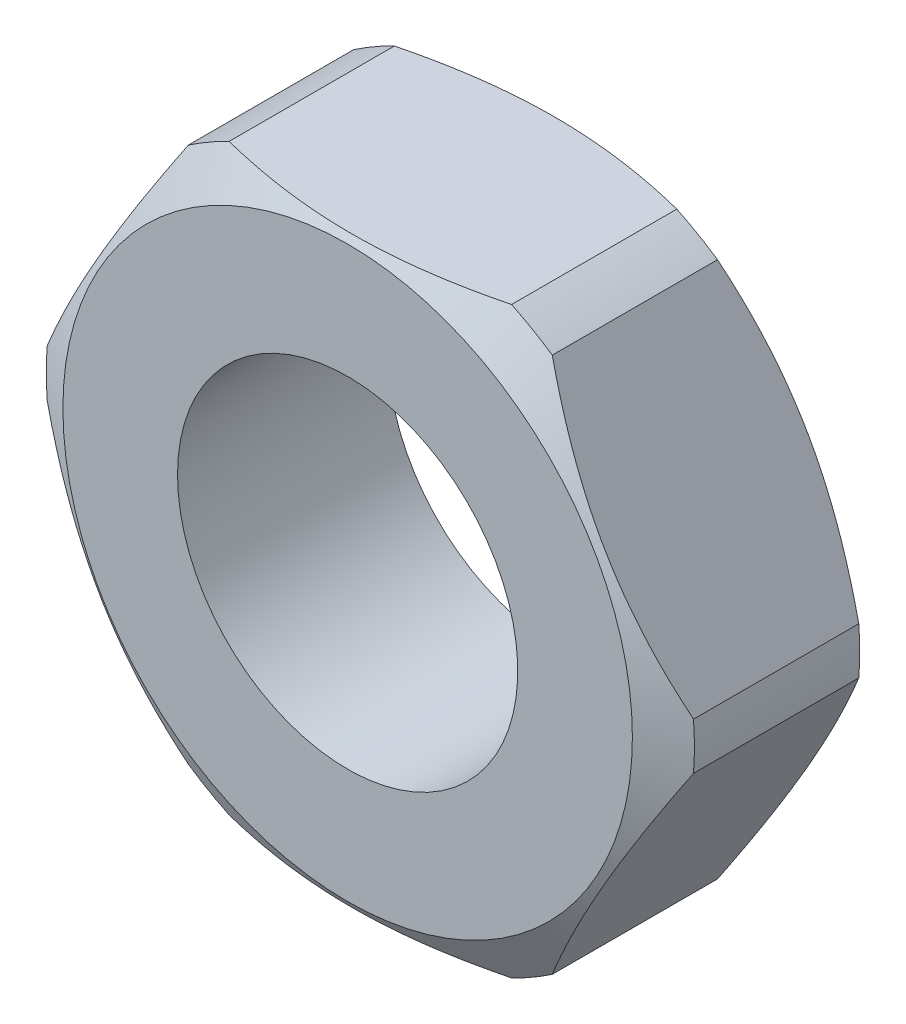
ISO-10303-21;
HEADER;
FILE_DESCRIPTION(('STEP AP214'),'2;1');
FILE_NAME('part.step','',(''),(''),'','','');
FILE_SCHEMA(('AUTOMOTIVE_DESIGN { 1 0 10303 214 1 1 1 1 }'));
ENDSEC;
DATA;
#1=APPLICATION_CONTEXT('core data for automotive mechanical design processes');
#2=APPLICATION_PROTOCOL_DEFINITION('international standard','automotive_design',2000,#1);
#3=PRODUCT_CONTEXT('',#1,'mechanical');
#4=PRODUCT('Part','Part','',(#3));
#5=PRODUCT_RELATED_PRODUCT_CATEGORY('part','',(#4));
#6=PRODUCT_DEFINITION_FORMATION('','',#4);
#7=PRODUCT_DEFINITION_CONTEXT('part definition',#1,'design');
#8=PRODUCT_DEFINITION('design','',#6,#7);
#9=PRODUCT_DEFINITION_SHAPE('','',#8);
#10=(LENGTH_UNIT() NAMED_UNIT(*) SI_UNIT(.MILLI.,.METRE.));
#11=(NAMED_UNIT(*) PLANE_ANGLE_UNIT() SI_UNIT($,.RADIAN.));
#12=(NAMED_UNIT(*) SI_UNIT($,.STERADIAN.) SOLID_ANGLE_UNIT());
#13=UNCERTAINTY_MEASURE_WITH_UNIT(LENGTH_MEASURE(1.E-05),#10,'distance_accuracy_value','');
#14=(GEOMETRIC_REPRESENTATION_CONTEXT(3) GLOBAL_UNCERTAINTY_ASSIGNED_CONTEXT((#13)) GLOBAL_UNIT_ASSIGNED_CONTEXT((#10,
#11,#12)) REPRESENTATION_CONTEXT('',''));
#15=CARTESIAN_POINT('',(0.,0.,0.));
#16=DIRECTION('',(0.,0.,1.));
#17=DIRECTION('',(1.,0.,0.));
#18=AXIS2_PLACEMENT_3D('',#15,#16,#17);
#19=CARTESIAN_POINT('',(0.,0.,6.5));
#20=DIRECTION('',(0.,0.,-1.));
#21=DIRECTION('',(-1.,0.,0.));
#22=AXIS2_PLACEMENT_3D('',#19,#20,#21);
#23=CYLINDRICAL_SURFACE('',#22,10.);
#24=CARTESIAN_POINT('',(0.,0.,5.79999999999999));
#25=DIRECTION('',(0.,0.,1.));
#26=DIRECTION('',(1.,0.,0.));
#27=AXIS2_PLACEMENT_3D('',#24,#25,#26);
#28=CIRCLE('',#27,10.);
#29=CARTESIAN_POINT('',(-9.9737559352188,-0.724011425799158,5.79999999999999));
#30=VERTEX_POINT('',#29);
#31=CARTESIAN_POINT('',(-9.97370406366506,0.72472563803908,5.79999999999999));
#32=VERTEX_POINT('',#31);
#33=EDGE_CURVE('E143',#30,#32,#28,.F.);
#34=ORIENTED_EDGE('',*,*,#33,.T.);
#35=DIRECTION('',(0.,0.,-1.));
#36=VECTOR('',#35,1.);
#37=CARTESIAN_POINT('',(-9.97370406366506,0.724725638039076,6.5));
#38=LINE('',#37,#36);
#39=CARTESIAN_POINT('',(-9.97370406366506,0.724725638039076,0.700000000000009));
#40=VERTEX_POINT('',#39);
#41=EDGE_CURVE('E51',#32,#40,#38,.T.);
#42=ORIENTED_EDGE('',*,*,#41,.T.);
#43=CARTESIAN_POINT('',(0.,0.,0.700000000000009));
#44=DIRECTION('',(0.,0.,1.));
#45=DIRECTION('',(1.,0.,0.));
#46=AXIS2_PLACEMENT_3D('',#43,#44,#45);
#47=CIRCLE('',#46,10.);
#48=CARTESIAN_POINT('',(-9.9737559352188,-0.724011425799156,0.700000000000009));
#49=VERTEX_POINT('',#48);
#50=EDGE_CURVE('E291',#40,#49,#47,.T.);
#51=ORIENTED_EDGE('',*,*,#50,.T.);
#52=DIRECTION('',(0.,0.,-1.));
#53=VECTOR('',#52,1.);
#54=CARTESIAN_POINT('',(-9.9737559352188,-0.724011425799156,6.5));
#55=LINE('',#54,#53);
#56=EDGE_CURVE('E290',#49,#30,#55,.F.);
#57=ORIENTED_EDGE('',*,*,#56,.T.);
#58=EDGE_LOOP('',(#34,#42,#51,#57));
#59=FACE_BOUND('',#58,.T.);
#60=ADVANCED_FACE('F32',(#59),#23,.T.);
#61=CARTESIAN_POINT('',(-4.3601878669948,-8.99937563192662,5.80000000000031));
#62=VERTEX_POINT('',#61);
#63=CARTESIAN_POINT('',(-5.61389025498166,-8.27552029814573,5.79999999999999));
#64=VERTEX_POINT('',#63);
#65=EDGE_CURVE('E147',#62,#64,#28,.F.);
#66=ORIENTED_EDGE('',*,*,#65,.T.);
#67=DIRECTION('',(0.,0.,-1.));
#68=VECTOR('',#67,1.);
#69=CARTESIAN_POINT('',(-5.61389025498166,-8.27552029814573,6.5));
#70=LINE('',#69,#68);
#71=CARTESIAN_POINT('',(-5.61389025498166,-8.27552029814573,0.700000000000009));
#72=VERTEX_POINT('',#71);
#73=EDGE_CURVE('E59',#64,#72,#70,.T.);
#74=ORIENTED_EDGE('',*,*,#73,.T.);
#75=CARTESIAN_POINT('',(-4.36018786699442,-8.99937563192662,0.700000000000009));
#76=VERTEX_POINT('',#75);
#77=EDGE_CURVE('E299',#72,#76,#47,.T.);
#78=ORIENTED_EDGE('',*,*,#77,.T.);
#79=DIRECTION('',(0.,0.,-1.));
#80=VECTOR('',#79,1.);
#81=CARTESIAN_POINT('',(-4.36018786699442,-8.99937563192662,6.5));
#82=LINE('',#81,#80);
#83=EDGE_CURVE('E177',#76,#62,#82,.F.);
#84=ORIENTED_EDGE('',*,*,#83,.T.);
#85=EDGE_LOOP('',(#66,#74,#78,#84));
#86=FACE_BOUND('',#85,.T.);
#87=ADVANCED_FACE('F174',(#86),#23,.T.);
#88=CARTESIAN_POINT('',(5.61389025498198,-8.27552029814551,5.79999999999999));
#89=VERTEX_POINT('',#88);
#90=CARTESIAN_POINT('',(4.36018786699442,-8.99937563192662,5.79999999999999));
#91=VERTEX_POINT('',#90);
#92=EDGE_CURVE('E160',#89,#91,#28,.F.);
#93=ORIENTED_EDGE('',*,*,#92,.T.);
#94=DIRECTION('',(0.,0.,-1.));
#95=VECTOR('',#94,1.);
#96=CARTESIAN_POINT('',(4.36018786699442,-8.99937563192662,6.5));
#97=LINE('',#96,#95);
#98=CARTESIAN_POINT('',(4.36018786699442,-8.99937563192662,0.700000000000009));
#99=VERTEX_POINT('',#98);
#100=EDGE_CURVE('E255',#91,#99,#97,.T.);
#101=ORIENTED_EDGE('',*,*,#100,.T.);
#102=CARTESIAN_POINT('',(5.61389025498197,-8.27552029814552,0.700000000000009));
#103=VERTEX_POINT('',#102);
#104=EDGE_CURVE('E301',#99,#103,#47,.T.);
#105=ORIENTED_EDGE('',*,*,#104,.T.);
#106=DIRECTION('',(0.,0.,-1.));
#107=VECTOR('',#106,1.);
#108=CARTESIAN_POINT('',(5.61389025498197,-8.27552029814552,6.5));
#109=LINE('',#108,#107);
#110=EDGE_CURVE('E254',#103,#89,#109,.F.);
#111=ORIENTED_EDGE('',*,*,#110,.T.);
#112=EDGE_LOOP('',(#93,#101,#105,#111));
#113=FACE_BOUND('',#112,.T.);
#114=ADVANCED_FACE('F288',(#113),#23,.T.);
#115=CARTESIAN_POINT('',(9.97370406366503,0.724725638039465,5.79999999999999));
#116=VERTEX_POINT('',#115);
#117=CARTESIAN_POINT('',(9.97375593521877,-0.724011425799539,5.79999999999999));
#118=VERTEX_POINT('',#117);
#119=EDGE_CURVE('E154',#116,#118,#28,.F.);
#120=ORIENTED_EDGE('',*,*,#119,.T.);
#121=DIRECTION('',(0.,0.,-1.));
#122=VECTOR('',#121,1.);
#123=CARTESIAN_POINT('',(9.97375593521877,-0.724011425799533,6.5));
#124=LINE('',#123,#122);
#125=CARTESIAN_POINT('',(9.97375593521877,-0.724011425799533,0.700000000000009));
#126=VERTEX_POINT('',#125);
#127=EDGE_CURVE('E256',#118,#126,#124,.T.);
#128=ORIENTED_EDGE('',*,*,#127,.T.);
#129=CARTESIAN_POINT('',(9.97370406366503,0.724725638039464,0.700000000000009));
#130=VERTEX_POINT('',#129);
#131=EDGE_CURVE('E158',#126,#130,#47,.T.);
#132=ORIENTED_EDGE('',*,*,#131,.T.);
#133=DIRECTION('',(0.,0.,-1.));
#134=VECTOR('',#133,1.);
#135=CARTESIAN_POINT('',(9.97370406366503,0.724725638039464,6.5));
#136=LINE('',#135,#134);
#137=EDGE_CURVE('E258',#130,#116,#136,.F.);
#138=ORIENTED_EDGE('',*,*,#137,.T.);
#139=EDGE_LOOP('',(#120,#128,#132,#138));
#140=FACE_BOUND('',#139,.T.);
#141=ADVANCED_FACE('F335',(#140),#23,.T.);
#142=CARTESIAN_POINT('',(4.35889894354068,9.,5.79999999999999));
#143=VERTEX_POINT('',#142);
#144=CARTESIAN_POINT('',(5.61448284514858,8.27511826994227,5.79999999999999));
#145=VERTEX_POINT('',#144);
#146=EDGE_CURVE('E146',#143,#145,#28,.F.);
#147=ORIENTED_EDGE('',*,*,#146,.T.);
#148=DIRECTION('',(0.,0.,-1.));
#149=VECTOR('',#148,1.);
#150=CARTESIAN_POINT('',(5.61448284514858,8.27511826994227,6.5));
#151=LINE('',#150,#149);
#152=CARTESIAN_POINT('',(5.61448284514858,8.27511826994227,0.700000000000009));
#153=VERTEX_POINT('',#152);
#154=EDGE_CURVE('E262',#145,#153,#151,.T.);
#155=ORIENTED_EDGE('',*,*,#154,.T.);
#156=CARTESIAN_POINT('',(4.35889894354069,8.99999999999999,0.700000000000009));
#157=VERTEX_POINT('',#156);
#158=EDGE_CURVE('E153',#153,#157,#47,.T.);
#159=ORIENTED_EDGE('',*,*,#158,.T.);
#160=DIRECTION('',(0.,0.,-1.));
#161=VECTOR('',#160,1.);
#162=CARTESIAN_POINT('',(4.35889894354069,8.99999999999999,6.5));
#163=LINE('',#162,#161);
#164=EDGE_CURVE('E265',#157,#143,#163,.F.);
#165=ORIENTED_EDGE('',*,*,#164,.T.);
#166=EDGE_LOOP('',(#147,#155,#159,#165));
#167=FACE_BOUND('',#166,.T.);
#168=ADVANCED_FACE('F282',(#167),#23,.T.);
#169=CARTESIAN_POINT('',(0.,0.,6.5));
#170=DIRECTION('',(0.,0.,1.));
#171=DIRECTION('',(1.,0.,0.));
#172=AXIS2_PLACEMENT_3D('',#169,#170,#171);
#173=PLANE('',#172);
#174=CARTESIAN_POINT('',(0.,0.,6.5));
#175=DIRECTION('',(0.,0.,1.));
#176=DIRECTION('',(1.,0.,0.));
#177=AXIS2_PLACEMENT_3D('',#174,#175,#176);
#178=CIRCLE('',#177,8.78756443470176);
#179=CARTESIAN_POINT('',(8.78756443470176,0.,6.5));
#180=VERTEX_POINT('',#179);
#181=EDGE_CURVE('E305',#180,#180,#178,.T.);
#182=ORIENTED_EDGE('',*,*,#181,.T.);
#183=EDGE_LOOP('',(#182));
#184=FACE_BOUND('',#183,.T.);
#185=CARTESIAN_POINT('',(0.,0.,6.5));
#186=DIRECTION('',(0.,0.,1.));
#187=DIRECTION('',(1.,0.,0.));
#188=AXIS2_PLACEMENT_3D('',#185,#186,#187);
#189=CIRCLE('',#188,5.25);
#190=CARTESIAN_POINT('',(-5.25,0.,6.5));
#191=VERTEX_POINT('',#190);
#192=EDGE_CURVE('E144',#191,#191,#189,.T.);
#193=ORIENTED_EDGE('',*,*,#192,.F.);
#194=EDGE_LOOP('',(#193));
#195=FACE_BOUND('',#194,.T.);
#196=ADVANCED_FACE('F334',(#184,#195),#173,.T.);
#197=CARTESIAN_POINT('',(0.,0.,0.));
#198=DIRECTION('',(0.,0.,1.));
#199=DIRECTION('',(1.,0.,0.));
#200=AXIS2_PLACEMENT_3D('',#197,#198,#199);
#201=PLANE('',#200);
#202=CARTESIAN_POINT('',(0.,0.,0.));
#203=DIRECTION('',(0.,0.,1.));
#204=DIRECTION('',(1.,0.,0.));
#205=AXIS2_PLACEMENT_3D('',#202,#203,#204);
#206=CIRCLE('',#205,8.78756443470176);
#207=CARTESIAN_POINT('',(8.78756443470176,0.,0.));
#208=VERTEX_POINT('',#207);
#209=EDGE_CURVE('E300',#208,#208,#206,.F.);
#210=ORIENTED_EDGE('',*,*,#209,.T.);
#211=EDGE_LOOP('',(#210));
#212=FACE_BOUND('',#211,.T.);
#213=CARTESIAN_POINT('',(0.,0.,0.));
#214=DIRECTION('',(0.,0.,1.));
#215=DIRECTION('',(1.,0.,0.));
#216=AXIS2_PLACEMENT_3D('',#213,#214,#215);
#217=CIRCLE('',#216,5.25);
#218=CARTESIAN_POINT('',(-5.25,0.,0.));
#219=VERTEX_POINT('',#218);
#220=EDGE_CURVE('E149',#219,#219,#217,.T.);
#221=ORIENTED_EDGE('',*,*,#220,.T.);
#222=EDGE_LOOP('',(#221));
#223=FACE_BOUND('',#222,.T.);
#224=ADVANCED_FACE('F275',(#212,#223),#201,.F.);
#225=CARTESIAN_POINT('',(-4.35889894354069,8.99999999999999,0.700000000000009));
#226=VERTEX_POINT('',#225);
#227=CARTESIAN_POINT('',(-5.61448284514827,8.27511826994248,0.700000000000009));
#228=VERTEX_POINT('',#227);
#229=EDGE_CURVE('E136',#226,#228,#47,.T.);
#230=ORIENTED_EDGE('',*,*,#229,.T.);
#231=DIRECTION('',(0.,0.,-1.));
#232=VECTOR('',#231,1.);
#233=CARTESIAN_POINT('',(-5.61448284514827,8.27511826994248,6.5));
#234=LINE('',#233,#232);
#235=CARTESIAN_POINT('',(-5.61448284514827,8.27511826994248,5.79999999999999));
#236=VERTEX_POINT('',#235);
#237=EDGE_CURVE('E124',#228,#236,#234,.F.);
#238=ORIENTED_EDGE('',*,*,#237,.T.);
#239=CARTESIAN_POINT('',(-4.35889894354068,9.,5.79999999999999));
#240=VERTEX_POINT('',#239);
#241=EDGE_CURVE('E133',#236,#240,#28,.F.);
#242=ORIENTED_EDGE('',*,*,#241,.T.);
#243=DIRECTION('',(0.,0.,-1.));
#244=VECTOR('',#243,1.);
#245=CARTESIAN_POINT('',(-4.35889894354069,8.99999999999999,6.5));
#246=LINE('',#245,#244);
#247=EDGE_CURVE('E268',#240,#226,#246,.T.);
#248=ORIENTED_EDGE('',*,*,#247,.T.);
#249=EDGE_LOOP('',(#230,#238,#242,#248));
#250=FACE_BOUND('',#249,.T.);
#251=ADVANCED_FACE('F34',(#250),#23,.T.);
#252=CARTESIAN_POINT('',(0.,0.,6.5));
#253=DIRECTION('',(0.,0.,-1.));
#254=DIRECTION('',(-1.,0.,0.));
#255=AXIS2_PLACEMENT_3D('',#252,#253,#254);
#256=CYLINDRICAL_SURFACE('',#255,5.25);
#257=CARTESIAN_POINT('',(-5.25,0.,6.5));
#258=CARTESIAN_POINT('',(-5.25,0.,6.43229166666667));
#259=CARTESIAN_POINT('',(-5.25,0.,6.36458333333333));
#260=CARTESIAN_POINT('',(-5.25,0.,6.22916666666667));
#261=CARTESIAN_POINT('',(-5.25,0.,6.16145833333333));
#262=CARTESIAN_POINT('',(-5.25,0.,6.02604166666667));
#263=CARTESIAN_POINT('',(-5.25,0.,5.95833333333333));
#264=CARTESIAN_POINT('',(-5.25,0.,5.82291666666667));
#265=CARTESIAN_POINT('',(-5.25,0.,5.75520833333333));
#266=CARTESIAN_POINT('',(-5.25,0.,5.61979166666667));
#267=CARTESIAN_POINT('',(-5.25,0.,5.55208333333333));
#268=CARTESIAN_POINT('',(-5.25,0.,5.41666666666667));
#269=CARTESIAN_POINT('',(-5.25,0.,5.34895833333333));
#270=CARTESIAN_POINT('',(-5.25,0.,5.21354166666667));
#271=CARTESIAN_POINT('',(-5.25,0.,5.14583333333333));
#272=CARTESIAN_POINT('',(-5.25,0.,5.01041666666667));
#273=CARTESIAN_POINT('',(-5.25,0.,4.94270833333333));
#274=CARTESIAN_POINT('',(-5.25,0.,4.80729166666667));
#275=CARTESIAN_POINT('',(-5.25,0.,4.73958333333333));
#276=CARTESIAN_POINT('',(-5.25,0.,4.60416666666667));
#277=CARTESIAN_POINT('',(-5.25,0.,4.53645833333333));
#278=CARTESIAN_POINT('',(-5.25,0.,4.40104166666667));
#279=CARTESIAN_POINT('',(-5.25,0.,4.33333333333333));
#280=CARTESIAN_POINT('',(-5.25,0.,4.19791666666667));
#281=CARTESIAN_POINT('',(-5.25,0.,4.13020833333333));
#282=CARTESIAN_POINT('',(-5.25,0.,3.99479166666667));
#283=CARTESIAN_POINT('',(-5.25,0.,3.92708333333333));
#284=CARTESIAN_POINT('',(-5.25,0.,3.79166666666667));
#285=CARTESIAN_POINT('',(-5.25,0.,3.72395833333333));
#286=CARTESIAN_POINT('',(-5.25,0.,3.58854166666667));
#287=CARTESIAN_POINT('',(-5.25,0.,3.52083333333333));
#288=CARTESIAN_POINT('',(-5.25,0.,3.38541666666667));
#289=CARTESIAN_POINT('',(-5.25,0.,3.31770833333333));
#290=CARTESIAN_POINT('',(-5.25,0.,3.18229166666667));
#291=CARTESIAN_POINT('',(-5.25,0.,3.11458333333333));
#292=CARTESIAN_POINT('',(-5.25,0.,2.97916666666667));
#293=CARTESIAN_POINT('',(-5.25,0.,2.91145833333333));
#294=CARTESIAN_POINT('',(-5.25,0.,2.77604166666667));
#295=CARTESIAN_POINT('',(-5.25,0.,2.70833333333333));
#296=CARTESIAN_POINT('',(-5.25,0.,2.57291666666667));
#297=CARTESIAN_POINT('',(-5.25,0.,2.50520833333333));
#298=CARTESIAN_POINT('',(-5.25,0.,2.36979166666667));
#299=CARTESIAN_POINT('',(-5.25,0.,2.30208333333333));
#300=CARTESIAN_POINT('',(-5.25,0.,2.16666666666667));
#301=CARTESIAN_POINT('',(-5.25,0.,2.09895833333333));
#302=CARTESIAN_POINT('',(-5.25,0.,1.96354166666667));
#303=CARTESIAN_POINT('',(-5.25,0.,1.89583333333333));
#304=CARTESIAN_POINT('',(-5.25,0.,1.76041666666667));
#305=CARTESIAN_POINT('',(-5.25,0.,1.69270833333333));
#306=CARTESIAN_POINT('',(-5.25,0.,1.55729166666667));
#307=CARTESIAN_POINT('',(-5.25,0.,1.48958333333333));
#308=CARTESIAN_POINT('',(-5.25,0.,1.35416666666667));
#309=CARTESIAN_POINT('',(-5.25,0.,1.28645833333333));
#310=CARTESIAN_POINT('',(-5.25,0.,1.15104166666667));
#311=CARTESIAN_POINT('',(-5.25,0.,1.08333333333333));
#312=CARTESIAN_POINT('',(-5.25,0.,0.947916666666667));
#313=CARTESIAN_POINT('',(-5.25,0.,0.880208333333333));
#314=CARTESIAN_POINT('',(-5.25,0.,0.744791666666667));
#315=CARTESIAN_POINT('',(-5.25,0.,0.677083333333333));
#316=CARTESIAN_POINT('',(-5.25,0.,0.541666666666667));
#317=CARTESIAN_POINT('',(-5.25,0.,0.473958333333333));
#318=CARTESIAN_POINT('',(-5.25,0.,0.338541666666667));
#319=CARTESIAN_POINT('',(-5.25,0.,0.270833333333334));
#320=CARTESIAN_POINT('',(-5.25,0.,0.135416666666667));
#321=CARTESIAN_POINT('',(-5.25,0.,0.0677083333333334));
#322=CARTESIAN_POINT('',(-5.25,0.,0.));
#323=B_SPLINE_CURVE_WITH_KNOTS('',3,(#257,#258,#259,#260,#261,#262,#263,#264,#265,#266,#267,
#268,#269,#270,#271,#272,#273,#274,#275,#276,#277,#278,#279,#280,#281,#282,#283,#284,#285,#286,
#287,#288,#289,#290,#291,#292,#293,#294,#295,#296,#297,#298,#299,#300,#301,#302,#303,#304,#305,
#306,#307,#308,#309,#310,#311,#312,#313,#314,#315,#316,#317,#318,#319,#320,#321,#322),
.UNSPECIFIED.,.F.,.F.,(4,2,2,2,2,2,2,2,2,2,2,2,2,2,2,2,2,2,2,2,2,2,2,2,2,2,2,2,2,2,2,2,4),(0.,
0.203124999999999,0.40625,0.609375,0.812499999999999,1.015625,1.21875,1.421875,1.625,1.828125,
2.03125,2.234375,2.4375,2.640625,2.84375,3.046875,3.25,3.453125,3.65625,3.859375,4.0625,
4.265625,4.46875,4.671875,4.875,5.078125,5.28125,5.484375,5.6875,5.890625,6.09375,6.296875,6.5),.UNSPECIFIED.);
#324=EDGE_CURVE('BSEAM217',#191,#219,#323,.T.);
#325=ORIENTED_EDGE('',*,*,#192,.T.);
#326=ORIENTED_EDGE('',*,*,#220,.F.);
#327=ORIENTED_EDGE('',*,*,#324,.T.);
#328=ORIENTED_EDGE('',*,*,#324,.F.);
#329=EDGE_LOOP('',(#325,#327,#326,#328));
#330=FACE_BOUND('',#329,.T.);
#331=ADVANCED_FACE('F217',(#330),#256,.F.);
#332=CARTESIAN_POINT('',(0.,0.,0.700000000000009));
#333=DIRECTION('',(0.,0.,1.));
#334=DIRECTION('',(1.,0.,0.));
#335=AXIS2_PLACEMENT_3D('',#332,#333,#334);
#336=CONICAL_SURFACE('',#335,10.,1.0471975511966);
#337=CARTESIAN_POINT('',(-5.61408554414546,8.27580641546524,0.700200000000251));
#338=CARTESIAN_POINT('',(-5.72500756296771,8.083683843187,0.644355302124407));
#339=CARTESIAN_POINT('',(-5.83635129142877,7.89083084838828,0.591754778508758));
#340=CARTESIAN_POINT('',(-6.05986677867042,7.50369066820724,0.493801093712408));
#341=CARTESIAN_POINT('',(-6.17203878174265,7.30940305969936,0.448450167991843));
#342=CARTESIAN_POINT('',(-6.39728344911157,6.91926785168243,0.365732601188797));
#343=CARTESIAN_POINT('',(-6.51035714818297,6.72341845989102,0.328377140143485));
#344=CARTESIAN_POINT('',(-6.73713613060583,6.33062574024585,0.262465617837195));
#345=CARTESIAN_POINT('',(-6.85084134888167,6.1336825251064,0.233908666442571));
#346=CARTESIAN_POINT('',(-7.07639473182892,5.74301260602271,0.186705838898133));
#347=CARTESIAN_POINT('',(-7.18823276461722,5.54930345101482,0.167867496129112));
#348=CARTESIAN_POINT('',(-7.41220619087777,5.16137009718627,0.139653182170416));
#349=CARTESIAN_POINT('',(-7.52434157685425,4.96714591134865,0.130276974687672));
#350=CARTESIAN_POINT('',(-7.7486199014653,4.57868445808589,0.121214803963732));
#351=CARTESIAN_POINT('',(-7.86076275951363,4.38444733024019,0.12152095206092));
#352=CARTESIAN_POINT('',(-8.08492839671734,3.99618105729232,0.131794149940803));
#353=CARTESIAN_POINT('',(-8.19695118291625,3.80215189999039,0.141760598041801));
#354=CARTESIAN_POINT('',(-8.44839248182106,3.36664279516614,0.174759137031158));
#355=CARTESIAN_POINT('',(-8.5877259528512,3.125310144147,0.200415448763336));
#356=CARTESIAN_POINT('',(-8.8656059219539,2.64400791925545,0.265524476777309));
#357=CARTESIAN_POINT('',(-9.00415223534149,2.4040386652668,0.304980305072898));
#358=CARTESIAN_POINT('',(-9.28203258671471,1.92273577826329,0.397062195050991));
#359=CARTESIAN_POINT('',(-9.421352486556,1.68142663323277,0.449856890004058));
#360=CARTESIAN_POINT('',(-9.69870141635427,1.20104419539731,0.566845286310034));
#361=CARTESIAN_POINT('',(-9.83673122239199,0.9619695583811,0.631031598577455));
#362=CARTESIAN_POINT('',(-9.97410136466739,0.724037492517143,0.700200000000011));
#363=B_SPLINE_CURVE_WITH_KNOTS('',3,(#337,#338,#339,#340,#341,#342,#343,#344,#345,#346,#347,
#348,#349,#350,#351,#352,#353,#354,#355,#356,#357,#358,#359,#360,#361,#362),.UNSPECIFIED.,.F.,
.F.,(4,2,2,2,2,2,2,2,2,2,2,2,4),(0.,0.686309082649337,1.37282938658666,2.06030346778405,
2.74770797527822,3.42091913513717,4.09411348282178,4.76675936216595,5.43936334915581,
6.27851801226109,7.11786204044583,7.9684004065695,8.81838908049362),.UNSPECIFIED.);
#364=EDGE_CURVE('E293',#228,#40,#363,.T.);
#365=ORIENTED_EDGE('',*,*,#364,.F.);
#366=ORIENTED_EDGE('',*,*,#229,.F.);
#367=CARTESIAN_POINT('',(-12.8403183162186,9.,3.97955893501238));
#368=CARTESIAN_POINT('',(-12.65166724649,9.,3.89037053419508));
#369=CARTESIAN_POINT('',(-12.4627677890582,9.,3.8017078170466));
#370=CARTESIAN_POINT('',(-12.0844210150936,9.,3.62555281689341));
#371=CARTESIAN_POINT('',(-11.8949736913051,9.,3.53806054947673));
#372=CARTESIAN_POINT('',(-11.3256694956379,9.,3.27748891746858));
#373=CARTESIAN_POINT('',(-10.9449212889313,9.,3.10634834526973));
#374=CARTESIAN_POINT('',(-10.1782761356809,9.,2.76943698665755));
#375=CARTESIAN_POINT('',(-9.79236194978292,9.,2.60370531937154));
#376=CARTESIAN_POINT('',(-9.01716320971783,9.,2.28034865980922));
#377=CARTESIAN_POINT('',(-8.627878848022,9.,2.12272320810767));
#378=CARTESIAN_POINT('',(-7.8435769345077,9.,1.81701285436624));
#379=CARTESIAN_POINT('',(-7.44854165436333,9.,1.66897316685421));
#380=CARTESIAN_POINT('',(-6.653734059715,9.,1.3859680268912));
#381=CARTESIAN_POINT('',(-6.25396126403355,9.,1.25100391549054));
#382=CARTESIAN_POINT('',(-5.45004477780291,9.,0.998008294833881));
#383=CARTESIAN_POINT('',(-5.04591327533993,9.,0.879938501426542));
#384=CARTESIAN_POINT('',(-4.23219428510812,9.,0.664695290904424));
#385=CARTESIAN_POINT('',(-3.82260850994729,9.,0.567515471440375));
#386=CARTESIAN_POINT('',(-2.9815358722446,9.,0.395477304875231));
#387=CARTESIAN_POINT('',(-2.54982801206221,9.,0.321666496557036));
#388=CARTESIAN_POINT('',(-1.8990161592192,9.,0.235656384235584));
#389=CARTESIAN_POINT('',(-1.6815077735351,9.,0.211102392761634));
#390=CARTESIAN_POINT('',(-1.24568918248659,9.,0.170717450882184));
#391=CARTESIAN_POINT('',(-1.02737905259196,9.,0.154885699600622));
#392=CARTESIAN_POINT('',(-0.591210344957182,9.,0.132344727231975));
#393=CARTESIAN_POINT('',(-0.373353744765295,9.,0.125597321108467));
#394=CARTESIAN_POINT('',(0.0624487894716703,9.,0.121252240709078));
#395=CARTESIAN_POINT('',(0.280394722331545,9.,0.123654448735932));
#396=CARTESIAN_POINT('',(0.715946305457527,9.,0.137553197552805));
#397=CARTESIAN_POINT('',(0.933552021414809,9.,0.149047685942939));
#398=CARTESIAN_POINT('',(1.36812050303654,9.,0.180869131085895));
#399=CARTESIAN_POINT('',(1.5850832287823,9.,0.201196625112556));
#400=CARTESIAN_POINT('',(2.13129619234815,9.,0.263100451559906));
#401=CARTESIAN_POINT('',(2.45992594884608,9.,0.310229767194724));
#402=CARTESIAN_POINT('',(3.11420613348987,9.,0.421964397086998));
#403=CARTESIAN_POINT('',(3.43985601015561,9.,0.486572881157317));
#404=CARTESIAN_POINT('',(4.08848304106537,9.,0.631055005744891));
#405=CARTESIAN_POINT('',(4.41145260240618,9.,0.710962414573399));
#406=CARTESIAN_POINT('',(5.05389906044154,9.,0.883594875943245));
#407=CARTESIAN_POINT('',(5.37337612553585,9.,0.976319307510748));
#408=CARTESIAN_POINT('',(6.01519241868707,9.,1.17436432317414));
#409=CARTESIAN_POINT('',(6.33746642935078,9.,1.2798948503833));
#410=CARTESIAN_POINT('',(6.97887330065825,9.,1.50013737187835));
#411=CARTESIAN_POINT('',(7.29800590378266,9.,1.61485011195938));
#412=CARTESIAN_POINT('',(7.93157009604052,9.,1.8511283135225));
#413=CARTESIAN_POINT('',(8.24601829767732,9.,1.97264947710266));
#414=CARTESIAN_POINT('',(8.87234481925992,9.,2.22187406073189));
#415=CARTESIAN_POINT('',(9.18422391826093,9.,2.34957551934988));
#416=CARTESIAN_POINT('',(9.49503159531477,9.,2.4797664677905));
#417=B_SPLINE_CURVE_WITH_KNOTS('',3,(#367,#368,#369,#370,#371,#372,#373,#374,#375,#376,#377,
#378,#379,#380,#381,#382,#383,#384,#385,#386,#387,#388,#389,#390,#391,#392,#393,#394,#395,#396,
#397,#398,#399,#400,#401,#402,#403,#404,#405,#406,#407,#408,#409,#410,#411,#412,#413,#414,#415,
#416),.UNSPECIFIED.,.F.,.F.,(4,2,2,2,2,2,2,2,2,2,2,2,2,2,2,2,2,2,2,2,2,2,2,2,4),(0.,
0.626013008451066,1.25203434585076,2.50431237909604,3.76422851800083,5.02407317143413,
6.28948240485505,7.55502128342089,8.81764530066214,10.079881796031,11.3925738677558,
12.0490962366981,12.7055583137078,13.3592523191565,14.0129379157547,14.666475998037,
15.3200538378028,16.3154600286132,17.3110468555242,18.3088570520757,19.3066189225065,
20.3237901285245,21.3410440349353,22.3523118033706,23.3632607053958),.UNSPECIFIED.);
#418=EDGE_CURVE('E223',#157,#226,#417,.F.);
#419=ORIENTED_EDGE('',*,*,#418,.F.);
#420=ORIENTED_EDGE('',*,*,#158,.F.);
#421=CARTESIAN_POINT('',(9.97410136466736,0.724037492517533,0.70020000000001));
#422=CARTESIAN_POINT('',(9.86317934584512,0.916160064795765,0.644355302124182));
#423=CARTESIAN_POINT('',(9.75183561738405,1.10901305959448,0.591754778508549));
#424=CARTESIAN_POINT('',(9.52832013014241,1.49615323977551,0.493801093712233));
#425=CARTESIAN_POINT('',(9.41614812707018,1.69044084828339,0.448450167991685));
#426=CARTESIAN_POINT('',(9.19090345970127,2.0805760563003,0.365732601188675));
#427=CARTESIAN_POINT('',(9.07782976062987,2.27642544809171,0.32837714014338));
#428=CARTESIAN_POINT('',(8.85105077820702,2.66921816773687,0.262465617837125));
#429=CARTESIAN_POINT('',(8.73734555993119,2.86616138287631,0.233908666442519));
#430=CARTESIAN_POINT('',(8.51179217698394,3.25683130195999,0.186705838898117));
#431=CARTESIAN_POINT('',(8.39995414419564,3.45054045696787,0.167867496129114));
#432=CARTESIAN_POINT('',(8.1759807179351,3.83847381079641,0.139653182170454));
#433=CARTESIAN_POINT('',(8.06384533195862,4.03269799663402,0.130276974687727));
#434=CARTESIAN_POINT('',(7.83956700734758,4.42115944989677,0.121214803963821));
#435=CARTESIAN_POINT('',(7.72742414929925,4.61539657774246,0.121520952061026));
#436=CARTESIAN_POINT('',(7.50325851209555,5.00366285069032,0.131794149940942));
#437=CARTESIAN_POINT('',(7.39123572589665,5.19769200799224,0.141760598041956));
#438=CARTESIAN_POINT('',(7.13979442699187,5.63320111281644,0.174759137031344));
#439=CARTESIAN_POINT('',(7.00046095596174,5.87453376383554,0.200415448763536));
#440=CARTESIAN_POINT('',(6.72258098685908,6.35583598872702,0.265524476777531));
#441=CARTESIAN_POINT('',(6.58403467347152,6.59580524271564,0.304980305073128));
#442=CARTESIAN_POINT('',(6.30615432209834,7.07710812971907,0.397062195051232));
#443=CARTESIAN_POINT('',(6.16683442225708,7.31841727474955,0.449856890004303));
#444=CARTESIAN_POINT('',(5.88948549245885,7.79879971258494,0.56684528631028));
#445=CARTESIAN_POINT('',(5.75145568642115,8.03787434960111,0.631031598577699));
#446=CARTESIAN_POINT('',(5.61408554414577,8.27580641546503,0.70020000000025));
#447=B_SPLINE_CURVE_WITH_KNOTS('',3,(#421,#422,#423,#424,#425,#426,#427,#428,#429,#430,#431,
#432,#433,#434,#435,#436,#437,#438,#439,#440,#441,#442,#443,#444,#445,#446),.UNSPECIFIED.,.F.,
.F.,(4,2,2,2,2,2,2,2,2,2,2,2,4),(0.,0.686309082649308,1.3728293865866,2.06030346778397,
2.74770797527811,3.42091913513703,4.09411348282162,4.76675936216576,5.43936334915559,
6.27851801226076,7.11786204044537,7.96840040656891,8.8183890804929),.UNSPECIFIED.);
#448=EDGE_CURVE('E233',#130,#153,#447,.T.);
#449=ORIENTED_EDGE('',*,*,#448,.F.);
#450=ORIENTED_EDGE('',*,*,#131,.F.);
#451=CARTESIAN_POINT('',(5.61349301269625,-8.2762083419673,0.700200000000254));
#452=CARTESIAN_POINT('',(5.7244140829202,-8.08408741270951,0.64434753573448));
#453=CARTESIAN_POINT('',(5.83575687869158,-7.89123603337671,0.591738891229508));
#454=CARTESIAN_POINT('',(6.05927057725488,-7.50409895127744,0.493768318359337));
#455=CARTESIAN_POINT('',(6.17144172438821,-7.30981282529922,0.448408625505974));
#456=CARTESIAN_POINT('',(6.39668488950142,-6.91968021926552,0.365672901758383));
#457=CARTESIAN_POINT('',(6.50975794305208,-6.72383194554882,0.328308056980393));
#458=CARTESIAN_POINT('',(6.73653579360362,-6.3310411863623,0.262377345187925));
#459=CARTESIAN_POINT('',(6.85024052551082,-6.13409881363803,0.233810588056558));
#460=CARTESIAN_POINT('',(7.0757926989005,-5.74343098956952,0.186588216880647));
#461=CARTESIAN_POINT('',(7.18763000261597,-5.54972309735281,0.167740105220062));
#462=CARTESIAN_POINT('',(7.41160217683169,-5.16179191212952,0.139506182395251));
#463=CARTESIAN_POINT('',(7.52373703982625,-4.96756863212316,0.130120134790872));
#464=CARTESIAN_POINT('',(7.74801450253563,-4.57910867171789,0.121038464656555));
#465=CARTESIAN_POINT('',(7.86015702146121,-4.38487213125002,0.12133495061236));
#466=CARTESIAN_POINT('',(8.08432218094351,-3.99660668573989,0.13158921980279));
#467=CARTESIAN_POINT('',(8.19634482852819,-3.80257776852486,0.141546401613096));
#468=CARTESIAN_POINT('',(8.4478412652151,-3.36697316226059,0.174532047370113));
#469=CARTESIAN_POINT('',(8.58722987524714,-3.12554500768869,0.200190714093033));
#470=CARTESIAN_POINT('',(8.86521961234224,-2.64405265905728,0.265316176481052));
#471=CARTESIAN_POINT('',(9.00382055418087,-2.40398878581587,0.304786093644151));
#472=CARTESIAN_POINT('',(9.28181106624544,-1.92249509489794,0.396906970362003));
#473=CARTESIAN_POINT('',(9.42118647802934,-1.6810898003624,0.449726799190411));
#474=CARTESIAN_POINT('',(9.69864521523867,-1.20051717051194,0.566774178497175));
#475=CARTESIAN_POINT('',(9.83672931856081,-0.961348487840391,0.630994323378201));
#476=CARTESIAN_POINT('',(9.97415317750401,-0.723323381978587,0.700200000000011));
#477=B_SPLINE_CURVE_WITH_KNOTS('',3,(#451,#452,#453,#454,#455,#456,#457,#458,#459,#460,#461,
#462,#463,#464,#465,#466,#467,#468,#469,#470,#471,#472,#473,#474,#475,#476),.UNSPECIFIED.,.F.,
.F.,(4,2,2,2,2,2,2,2,2,2,2,2,4),(0.,0.686309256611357,1.37282975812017,2.06030462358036,
2.74770991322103,3.42091917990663,4.09411162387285,4.76675541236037,5.43935732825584,
6.2788415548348,7.11851563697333,7.96939499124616,8.81972362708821),.UNSPECIFIED.);
#478=EDGE_CURVE('E242',#103,#126,#477,.T.);
#479=ORIENTED_EDGE('',*,*,#478,.F.);
#480=ORIENTED_EDGE('',*,*,#104,.F.);
#481=CARTESIAN_POINT('',(-12.8402093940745,-8.99937563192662,3.97930053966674));
#482=CARTESIAN_POINT('',(-12.6515621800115,-8.99937563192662,3.89011217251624));
#483=CARTESIAN_POINT('',(-12.4626665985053,-8.99937563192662,3.80144943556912));
#484=CARTESIAN_POINT('',(-12.0843276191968,-8.99937563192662,3.62529427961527));
#485=CARTESIAN_POINT('',(-11.8948842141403,-8.99937563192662,3.53780187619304));
#486=CARTESIAN_POINT('',(-11.3255918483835,-8.99937563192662,3.27722965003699));
#487=CARTESIAN_POINT('',(-10.9448516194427,-8.99937563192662,3.10608843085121));
#488=CARTESIAN_POINT('',(-10.1782226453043,-8.99937563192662,2.76917517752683));
#489=CARTESIAN_POINT('',(-9.7923166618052,-8.99937563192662,2.60344225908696));
#490=CARTESIAN_POINT('',(-9.01713451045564,-8.99937563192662,2.28008240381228));
#491=CARTESIAN_POINT('',(-8.62785853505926,-8.99937563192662,2.1224550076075));
#492=CARTESIAN_POINT('',(-7.84357151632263,-8.99937563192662,1.81673915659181));
#493=CARTESIAN_POINT('',(-7.44854272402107,-8.99937563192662,1.66869596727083));
#494=CARTESIAN_POINT('',(-6.65374815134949,-8.99937563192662,1.38568310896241));
#495=CARTESIAN_POINT('',(-6.25398188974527,-8.99937563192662,1.25071478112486));
#496=CARTESIAN_POINT('',(-5.45007840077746,-8.99937563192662,0.997710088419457));
#497=CARTESIAN_POINT('',(-5.04595336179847,-8.99937563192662,0.879635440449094));
#498=CARTESIAN_POINT('',(-4.23224706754,-8.99937563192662,0.664382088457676));
#499=CARTESIAN_POINT('',(-3.82266752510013,-8.99937563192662,0.567196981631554));
#500=CARTESIAN_POINT('',(-2.98162699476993,-8.99937563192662,0.395152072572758));
#501=CARTESIAN_POINT('',(-2.54994526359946,-8.99937563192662,0.321338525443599));
#502=CARTESIAN_POINT('',(-1.89917242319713,-8.99937563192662,0.235322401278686));
#503=CARTESIAN_POINT('',(-1.68167701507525,-8.99937563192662,0.210766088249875));
#504=CARTESIAN_POINT('',(-1.24588428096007,-8.99937563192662,0.170375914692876));
#505=CARTESIAN_POINT('',(-1.02758703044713,-8.99937563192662,0.154541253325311));
#506=CARTESIAN_POINT('',(-0.59144423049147,-8.99937563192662,0.131993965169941));
#507=CARTESIAN_POINT('',(-0.373600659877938,-8.99937563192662,0.125243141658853));
#508=CARTESIAN_POINT('',(0.0621759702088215,-8.99937563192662,0.120890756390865));
#509=CARTESIAN_POINT('',(0.280109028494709,-8.99937563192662,0.123289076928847));
#510=CARTESIAN_POINT('',(0.715635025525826,-8.99937563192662,0.137179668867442));
#511=CARTESIAN_POINT('',(0.933228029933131,-8.99937563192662,0.148669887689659));
#512=CARTESIAN_POINT('',(1.36777125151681,-8.99937563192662,0.180482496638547));
#513=CARTESIAN_POINT('',(1.58472142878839,-8.99937563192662,0.200805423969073));
#514=CARTESIAN_POINT('',(2.13088865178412,-8.99937563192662,0.262695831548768));
#515=CARTESIAN_POINT('',(2.45948541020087,-8.99937563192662,0.309815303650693));
#516=CARTESIAN_POINT('',(3.11370016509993,-8.99937563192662,0.421528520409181));
#517=CARTESIAN_POINT('',(3.43931761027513,-8.99937563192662,0.486125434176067));
#518=CARTESIAN_POINT('',(4.08788021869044,-8.99937563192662,0.630583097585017));
#519=CARTESIAN_POINT('',(4.41081779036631,-8.99937563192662,0.710477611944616));
#520=CARTESIAN_POINT('',(5.05320072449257,-8.99937563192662,0.883083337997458));
#521=CARTESIAN_POINT('',(5.37264625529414,-8.99937563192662,0.975793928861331));
#522=CARTESIAN_POINT('',(6.01440024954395,-8.99937563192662,1.17381061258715));
#523=CARTESIAN_POINT('',(6.33664349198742,-8.99937563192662,1.27932666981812));
#524=CARTESIAN_POINT('',(6.97798910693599,-8.99937563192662,1.49953978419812));
#525=CARTESIAN_POINT('',(7.29709122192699,-8.99937563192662,1.61423758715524));
#526=CARTESIAN_POINT('',(7.9305948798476,-8.99937563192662,1.85048567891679));
#527=CARTESIAN_POINT('',(8.24501303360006,-8.99937563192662,1.97199167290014));
#528=CARTESIAN_POINT('',(8.8712796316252,-8.99937563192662,2.22118566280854));
#529=CARTESIAN_POINT('',(9.18312885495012,-8.99937563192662,2.34887169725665));
#530=CARTESIAN_POINT('',(9.49390671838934,-8.99937563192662,2.4790471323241));
#531=B_SPLINE_CURVE_WITH_KNOTS('',3,(#481,#482,#483,#484,#485,#486,#487,#488,#489,#490,#491,
#492,#493,#494,#495,#496,#497,#498,#499,#500,#501,#502,#503,#504,#505,#506,#507,#508,#509,#510,
#511,#512,#513,#514,#515,#516,#517,#518,#519,#520,#521,#522,#523,#524,#525,#526,#527,#528,#529,
#530),.UNSPECIFIED.,.F.,.F.,(4,2,2,2,2,2,2,2,2,2,2,2,2,2,2,2,2,2,2,2,2,2,2,2,4),(0.,
0.62600250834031,1.25201334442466,2.5042703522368,3.76416537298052,5.02398891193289,
6.28938362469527,7.55490799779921,8.81751750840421,10.0797394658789,11.392355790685,
12.0488402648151,12.7052644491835,13.3589197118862,14.0125665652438,14.6660658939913,
15.319604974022,16.3149090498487,17.3103937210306,18.3081014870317,19.3057609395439,
20.3228309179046,21.3399835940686,22.3511508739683,23.3619992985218),.UNSPECIFIED.);
#532=EDGE_CURVE('E249',#76,#99,#531,.T.);
#533=ORIENTED_EDGE('',*,*,#532,.F.);
#534=ORIENTED_EDGE('',*,*,#77,.F.);
#535=CARTESIAN_POINT('',(-9.97415317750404,-0.72332338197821,0.70020000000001));
#536=CARTESIAN_POINT('',(-9.8632321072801,-0.91544431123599,0.644347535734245));
#537=CARTESIAN_POINT('',(-9.75188931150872,-1.10829569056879,0.591738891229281));
#538=CARTESIAN_POINT('',(-9.52837561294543,-1.49543277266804,0.493768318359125));
#539=CARTESIAN_POINT('',(-9.4162044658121,-1.68971889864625,0.448408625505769));
#540=CARTESIAN_POINT('',(-9.1909613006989,-2.07985150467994,0.365672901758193));
#541=CARTESIAN_POINT('',(-9.07788824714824,-2.27569977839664,0.328308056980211));
#542=CARTESIAN_POINT('',(-8.85111039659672,-2.66849053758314,0.262377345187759));
#543=CARTESIAN_POINT('',(-8.73740566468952,-2.8654329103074,0.233810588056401));
#544=CARTESIAN_POINT('',(-8.51185349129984,-3.2561007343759,0.186588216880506));
#545=CARTESIAN_POINT('',(-8.40001618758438,-3.4498086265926,0.167740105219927));
#546=CARTESIAN_POINT('',(-8.17604401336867,-3.83773981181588,0.139506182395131));
#547=CARTESIAN_POINT('',(-8.06390915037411,-4.03196309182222,0.13012013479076));
#548=CARTESIAN_POINT('',(-7.83963168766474,-4.42042305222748,0.121038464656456));
#549=CARTESIAN_POINT('',(-7.72748916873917,-4.61465959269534,0.121334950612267));
#550=CARTESIAN_POINT('',(-7.50332400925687,-5.00292503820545,0.131589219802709));
#551=CARTESIAN_POINT('',(-7.39130136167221,-5.19695395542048,0.141546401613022));
#552=CARTESIAN_POINT('',(-7.13980492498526,-5.6325585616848,0.174532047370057));
#553=CARTESIAN_POINT('',(-7.00041631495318,-5.87398671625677,0.200190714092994));
#554=CARTESIAN_POINT('',(-6.72242657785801,-6.35547906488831,0.265316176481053));
#555=CARTESIAN_POINT('',(-6.58382563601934,-6.59554293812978,0.304786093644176));
#556=CARTESIAN_POINT('',(-6.30583512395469,-7.07703662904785,0.396906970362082));
#557=CARTESIAN_POINT('',(-6.16645971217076,-7.31844192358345,0.44972679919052));
#558=CARTESIAN_POINT('',(-5.88900097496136,-7.79901455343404,0.566774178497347));
#559=CARTESIAN_POINT('',(-5.75091687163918,-8.03818323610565,0.630994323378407));
#560=CARTESIAN_POINT('',(-5.61349301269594,-8.27620834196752,0.700200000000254));
#561=B_SPLINE_CURVE_WITH_KNOTS('',3,(#535,#536,#537,#538,#539,#540,#541,#542,#543,#544,#545,
#546,#547,#548,#549,#550,#551,#552,#553,#554,#555,#556,#557,#558,#559,#560),.UNSPECIFIED.,.F.,
.F.,(4,2,2,2,2,2,2,2,2,2,2,2,4),(0.,0.68630925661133,1.37282975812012,2.06030462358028,
2.74770991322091,3.42091917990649,4.09411162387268,4.76675541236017,5.43935732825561,
6.2788415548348,7.11851563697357,7.96939499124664,8.81972362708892),.UNSPECIFIED.);
#562=EDGE_CURVE('E205',#49,#72,#561,.T.);
#563=ORIENTED_EDGE('',*,*,#562,.F.);
#564=ORIENTED_EDGE('',*,*,#50,.F.);
#565=EDGE_LOOP('',(#365,#366,#419,#420,#449,#450,#479,#480,#533,#534,#563,#564));
#566=FACE_BOUND('',#565,.T.);
#567=ORIENTED_EDGE('',*,*,#209,.F.);
#568=EDGE_LOOP('',(#567));
#569=FACE_BOUND('',#568,.T.);
#570=ADVANCED_FACE('F213',(#566,#569),#336,.T.);
#571=CARTESIAN_POINT('',(0.,0.,6.5));
#572=DIRECTION('',(0.,0.,-1.));
#573=DIRECTION('',(-1.,0.,0.));
#574=AXIS2_PLACEMENT_3D('',#571,#572,#573);
#575=CONICAL_SURFACE('',#574,8.78756443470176,1.0471975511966);
#576=CARTESIAN_POINT('',(-9.97410136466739,0.724037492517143,5.79979999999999));
#577=CARTESIAN_POINT('',(-9.86317934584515,0.916160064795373,5.85564469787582));
#578=CARTESIAN_POINT('',(-9.75183561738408,1.10901305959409,5.90824522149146));
#579=CARTESIAN_POINT('',(-9.52832013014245,1.49615323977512,6.00619890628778));
#580=CARTESIAN_POINT('',(-9.41614812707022,1.69044084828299,6.05154983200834));
#581=CARTESIAN_POINT('',(-9.1909034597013,2.08057605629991,6.13426739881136));
#582=CARTESIAN_POINT('',(-9.07782976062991,2.27642544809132,6.17162285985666));
#583=CARTESIAN_POINT('',(-8.85105077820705,2.66921816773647,6.23753438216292));
#584=CARTESIAN_POINT('',(-8.73734555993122,2.86616138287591,6.26609133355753));
#585=CARTESIAN_POINT('',(-8.51179217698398,3.25683130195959,6.31329416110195));
#586=CARTESIAN_POINT('',(-8.39995414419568,3.45054045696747,6.33213250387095));
#587=CARTESIAN_POINT('',(-8.17598071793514,3.83847381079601,6.36034681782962));
#588=CARTESIAN_POINT('',(-8.06384533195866,4.03269799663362,6.36972302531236));
#589=CARTESIAN_POINT('',(-7.83956700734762,4.42115944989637,6.37878519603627));
#590=CARTESIAN_POINT('',(-7.72742414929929,4.61539657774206,6.37847904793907));
#591=CARTESIAN_POINT('',(-7.50325851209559,5.00366285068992,6.36820585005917));
#592=CARTESIAN_POINT('',(-7.39123572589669,5.19769200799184,6.35823940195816));
#593=CARTESIAN_POINT('',(-7.13979442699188,5.63320111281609,6.32524086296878));
#594=CARTESIAN_POINT('',(-7.00046095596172,5.87453376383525,6.29958455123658));
#595=CARTESIAN_POINT('',(-6.722580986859,6.35583598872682,6.23447552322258));
#596=CARTESIAN_POINT('',(-6.58403467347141,6.5958052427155,6.19501969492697));
#597=CARTESIAN_POINT('',(-6.30615432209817,7.07710812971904,6.10293780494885));
#598=CARTESIAN_POINT('',(-6.16683442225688,7.31841727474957,6.05014310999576));
#599=CARTESIAN_POINT('',(-5.88948549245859,7.79879971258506,5.93315471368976));
#600=CARTESIAN_POINT('',(-5.75145568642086,8.03787434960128,5.86896840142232));
#601=CARTESIAN_POINT('',(-5.61408554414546,8.27580641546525,5.79979999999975));
#602=B_SPLINE_CURVE_WITH_KNOTS('',3,(#576,#577,#578,#579,#580,#581,#582,#583,#584,#585,#586,
#587,#588,#589,#590,#591,#592,#593,#594,#595,#596,#597,#598,#599,#600,#601),.UNSPECIFIED.,.F.,
.F.,(4,2,2,2,2,2,2,2,2,2,2,2,4),(0.,0.686309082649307,1.3728293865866,2.06030346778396,
2.74770797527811,3.42091913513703,4.09411348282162,4.76675936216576,5.43936334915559,
6.27851801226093,7.11786204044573,7.96840040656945,8.81838908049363),.UNSPECIFIED.);
#603=EDGE_CURVE('E11',#32,#236,#602,.T.);
#604=ORIENTED_EDGE('',*,*,#603,.F.);
#605=ORIENTED_EDGE('',*,*,#33,.F.);
#606=CARTESIAN_POINT('',(-5.61349301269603,-8.27620834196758,5.79979999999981));
#607=CARTESIAN_POINT('',(-5.72441408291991,-8.08408741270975,5.85565246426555));
#608=CARTESIAN_POINT('',(-5.83575687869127,-7.89123603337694,5.9082611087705));
#609=CARTESIAN_POINT('',(-6.05927057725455,-7.50409895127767,6.00623168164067));
#610=CARTESIAN_POINT('',(-6.17144172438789,-7.30981282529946,6.05159137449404));
#611=CARTESIAN_POINT('',(-6.39668488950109,-6.91968021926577,6.13432709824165));
#612=CARTESIAN_POINT('',(-6.50975794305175,-6.72383194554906,6.17169194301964));
#613=CARTESIAN_POINT('',(-6.73653579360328,-6.33104118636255,6.23762265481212));
#614=CARTESIAN_POINT('',(-6.85024052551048,-6.13409881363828,6.26618941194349));
#615=CARTESIAN_POINT('',(-7.07579269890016,-5.74343098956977,6.31341178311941));
#616=CARTESIAN_POINT('',(-7.18763000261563,-5.54972309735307,6.33225989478));
#617=CARTESIAN_POINT('',(-7.41160217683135,-5.16179191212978,6.36049381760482));
#618=CARTESIAN_POINT('',(-7.5237370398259,-4.96756863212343,6.36987986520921));
#619=CARTESIAN_POINT('',(-7.74801450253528,-4.57910867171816,6.37896153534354));
#620=CARTESIAN_POINT('',(-7.86015702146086,-4.3848721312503,6.37866504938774));
#621=CARTESIAN_POINT('',(-8.08432218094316,-3.99660668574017,6.36841078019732));
#622=CARTESIAN_POINT('',(-8.19634482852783,-3.80257776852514,6.35845359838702));
#623=CARTESIAN_POINT('',(-8.44784126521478,-3.36697316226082,6.32546795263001));
#624=CARTESIAN_POINT('',(-8.58722987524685,-3.12554500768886,6.29980928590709));
#625=CARTESIAN_POINT('',(-8.86521961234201,-2.64405265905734,6.23468382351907));
#626=CARTESIAN_POINT('',(-9.00382055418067,-2.40398878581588,6.19521390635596));
#627=CARTESIAN_POINT('',(-9.28181106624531,-1.92249509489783,6.10309302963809));
#628=CARTESIAN_POINT('',(-9.42118647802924,-1.68108980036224,6.05027320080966));
#629=CARTESIAN_POINT('',(-9.69864521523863,-1.20051717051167,5.93322582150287));
#630=CARTESIAN_POINT('',(-9.83672931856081,-0.96134848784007,5.86900567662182));
#631=CARTESIAN_POINT('',(-9.97415317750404,-0.723323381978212,5.79979999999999));
#632=B_SPLINE_CURVE_WITH_KNOTS('',3,(#606,#607,#608,#609,#610,#611,#612,#613,#614,#615,#616,
#617,#618,#619,#620,#621,#622,#623,#624,#625,#626,#627,#628,#629,#630,#631),.UNSPECIFIED.,.F.,
.F.,(4,2,2,2,2,2,2,2,2,2,2,2,4),(0.,0.686309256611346,1.37282975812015,2.06030462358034,
2.74770991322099,3.42091917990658,4.09411162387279,4.76675541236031,5.43935732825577,
6.27884155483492,7.11851563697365,7.96939499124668,8.81972362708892),.UNSPECIFIED.);
#633=EDGE_CURVE('E45',#64,#30,#632,.T.);
#634=ORIENTED_EDGE('',*,*,#633,.F.);
#635=ORIENTED_EDGE('',*,*,#65,.F.);
#636=CARTESIAN_POINT('',(-12.8402093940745,-8.99937563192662,2.52069946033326));
#637=CARTESIAN_POINT('',(-12.6515621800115,-8.99937563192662,2.60988782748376));
#638=CARTESIAN_POINT('',(-12.4626665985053,-8.99937563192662,2.69855056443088));
#639=CARTESIAN_POINT('',(-12.0843276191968,-8.99937563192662,2.87470572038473));
#640=CARTESIAN_POINT('',(-11.8948842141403,-8.99937563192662,2.96219812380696));
#641=CARTESIAN_POINT('',(-11.3255918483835,-8.99937563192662,3.22277034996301));
#642=CARTESIAN_POINT('',(-10.9448516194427,-8.99937563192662,3.39391156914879));
#643=CARTESIAN_POINT('',(-10.1782226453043,-8.99937563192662,3.73082482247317));
#644=CARTESIAN_POINT('',(-9.7923166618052,-8.99937563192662,3.89655774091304));
#645=CARTESIAN_POINT('',(-9.01713451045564,-8.99937563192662,4.21991759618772));
#646=CARTESIAN_POINT('',(-8.62785853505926,-8.99937563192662,4.3775449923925));
#647=CARTESIAN_POINT('',(-7.84357151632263,-8.99937563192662,4.68326084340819));
#648=CARTESIAN_POINT('',(-7.44854272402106,-8.99937563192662,4.83130403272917));
#649=CARTESIAN_POINT('',(-6.65374815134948,-8.99937563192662,5.11431689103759));
#650=CARTESIAN_POINT('',(-6.25398188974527,-8.99937563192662,5.24928521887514));
#651=CARTESIAN_POINT('',(-5.45007840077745,-8.99937563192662,5.50228991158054));
#652=CARTESIAN_POINT('',(-5.04595336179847,-8.99937563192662,5.62036455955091));
#653=CARTESIAN_POINT('',(-4.23224706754,-8.99937563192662,5.83561791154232));
#654=CARTESIAN_POINT('',(-3.82266752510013,-8.99937563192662,5.93280301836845));
#655=CARTESIAN_POINT('',(-2.98162699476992,-8.99937563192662,6.10484792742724));
#656=CARTESIAN_POINT('',(-2.54994526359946,-8.99937563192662,6.1786614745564));
#657=CARTESIAN_POINT('',(-1.89917242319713,-8.99937563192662,6.26467759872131));
#658=CARTESIAN_POINT('',(-1.68167701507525,-8.99937563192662,6.28923391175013));
#659=CARTESIAN_POINT('',(-1.24588428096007,-8.99937563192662,6.32962408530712));
#660=CARTESIAN_POINT('',(-1.02758703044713,-8.99937563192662,6.34545874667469));
#661=CARTESIAN_POINT('',(-0.59144423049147,-8.99937563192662,6.36800603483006));
#662=CARTESIAN_POINT('',(-0.373600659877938,-8.99937563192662,6.37475685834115));
#663=CARTESIAN_POINT('',(0.0621759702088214,-8.99937563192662,6.37910924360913));
#664=CARTESIAN_POINT('',(0.280109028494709,-8.99937563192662,6.37671092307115));
#665=CARTESIAN_POINT('',(0.715635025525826,-8.99937563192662,6.36282033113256));
#666=CARTESIAN_POINT('',(0.93322802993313,-8.99937563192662,6.35133011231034));
#667=CARTESIAN_POINT('',(1.36777125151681,-8.99937563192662,6.31951750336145));
#668=CARTESIAN_POINT('',(1.58472142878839,-8.99937563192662,6.29919457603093));
#669=CARTESIAN_POINT('',(2.13088865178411,-8.99937563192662,6.23730416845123));
#670=CARTESIAN_POINT('',(2.45948541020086,-8.99937563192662,6.19018469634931));
#671=CARTESIAN_POINT('',(3.11370016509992,-8.99937563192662,6.07847147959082));
#672=CARTESIAN_POINT('',(3.43931761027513,-8.99937563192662,6.01387456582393));
#673=CARTESIAN_POINT('',(4.08788021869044,-8.99937563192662,5.86941690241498));
#674=CARTESIAN_POINT('',(4.41081779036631,-8.99937563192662,5.78952238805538));
#675=CARTESIAN_POINT('',(5.05320072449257,-8.99937563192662,5.61691666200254));
#676=CARTESIAN_POINT('',(5.37264625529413,-8.99937563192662,5.52420607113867));
#677=CARTESIAN_POINT('',(6.01440024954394,-8.99937563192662,5.32618938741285));
#678=CARTESIAN_POINT('',(6.33664349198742,-8.99937563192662,5.22067333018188));
#679=CARTESIAN_POINT('',(6.97798910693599,-8.99937563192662,5.00046021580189));
#680=CARTESIAN_POINT('',(7.29709122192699,-8.99937563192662,4.88576241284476));
#681=CARTESIAN_POINT('',(7.93059487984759,-8.99937563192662,4.64951432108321));
#682=CARTESIAN_POINT('',(8.24501303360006,-8.99937563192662,4.52800832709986));
#683=CARTESIAN_POINT('',(8.8712796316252,-8.99937563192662,4.27881433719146));
#684=CARTESIAN_POINT('',(9.18312885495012,-8.99937563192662,4.15112830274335));
#685=CARTESIAN_POINT('',(9.49390671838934,-8.99937563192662,4.0209528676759));
#686=B_SPLINE_CURVE_WITH_KNOTS('',3,(#636,#637,#638,#639,#640,#641,#642,#643,#644,#645,#646,
#647,#648,#649,#650,#651,#652,#653,#654,#655,#656,#657,#658,#659,#660,#661,#662,#663,#664,#665,
#666,#667,#668,#669,#670,#671,#672,#673,#674,#675,#676,#677,#678,#679,#680,#681,#682,#683,#684,
#685),.UNSPECIFIED.,.F.,.F.,(4,2,2,2,2,2,2,2,2,2,2,2,2,2,2,2,2,2,2,2,2,2,2,2,4),(0.,
0.626002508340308,1.25201334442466,2.5042703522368,3.76416537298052,5.0239889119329,
6.28938362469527,7.55490799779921,8.81751750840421,10.0797394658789,11.392355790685,
12.0488402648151,12.7052644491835,13.3589197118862,14.0125665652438,14.6660658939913,
15.319604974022,16.3149090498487,17.3103937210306,18.3081014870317,19.3057609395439,
20.3228309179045,21.3399835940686,22.3511508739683,23.3619992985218),.UNSPECIFIED.);
#687=EDGE_CURVE('E179',#91,#62,#686,.F.);
#688=ORIENTED_EDGE('',*,*,#687,.F.);
#689=ORIENTED_EDGE('',*,*,#92,.F.);
#690=CARTESIAN_POINT('',(9.97415317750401,-0.723323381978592,5.79979999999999));
#691=CARTESIAN_POINT('',(9.86323210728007,-0.915444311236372,5.85565246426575));
#692=CARTESIAN_POINT('',(9.75188931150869,-1.10829569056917,5.90826110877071));
#693=CARTESIAN_POINT('',(9.5283756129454,-1.49543277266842,6.00623168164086));
#694=CARTESIAN_POINT('',(9.41620446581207,-1.68971889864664,6.05159137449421));
#695=CARTESIAN_POINT('',(9.19096130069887,-2.07985150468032,6.13432709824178));
#696=CARTESIAN_POINT('',(9.07788824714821,-2.27569977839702,6.17169194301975));
#697=CARTESIAN_POINT('',(8.85111039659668,-2.66849053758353,6.23762265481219));
#698=CARTESIAN_POINT('',(8.73740566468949,-2.86543291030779,6.26618941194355));
#699=CARTESIAN_POINT('',(8.51185349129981,-3.25610073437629,6.31341178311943));
#700=CARTESIAN_POINT('',(8.40001618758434,-3.44980862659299,6.33225989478));
#701=CARTESIAN_POINT('',(8.17604401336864,-3.83773981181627,6.36049381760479));
#702=CARTESIAN_POINT('',(8.06390915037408,-4.03196309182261,6.36987986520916));
#703=CARTESIAN_POINT('',(7.83963168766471,-4.42042305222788,6.37896153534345));
#704=CARTESIAN_POINT('',(7.72748916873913,-4.61465959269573,6.37866504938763));
#705=CARTESIAN_POINT('',(7.50332400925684,-5.00292503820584,6.36841078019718));
#706=CARTESIAN_POINT('',(7.39130136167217,-5.19695395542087,6.35845359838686));
#707=CARTESIAN_POINT('',(7.13980492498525,-5.63255856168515,6.32546795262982));
#708=CARTESIAN_POINT('',(7.0004163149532,-5.87398671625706,6.29980928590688));
#709=CARTESIAN_POINT('',(6.72242657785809,-6.3554790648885,6.23468382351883));
#710=CARTESIAN_POINT('',(6.58382563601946,-6.59554293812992,6.19521390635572));
#711=CARTESIAN_POINT('',(6.30583512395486,-7.07703662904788,6.10309302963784));
#712=CARTESIAN_POINT('',(6.16645971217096,-7.31844192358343,6.05027320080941));
#713=CARTESIAN_POINT('',(5.88900097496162,-7.79901455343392,5.93322582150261));
#714=CARTESIAN_POINT('',(5.75091687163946,-8.03818323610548,5.86900567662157));
#715=CARTESIAN_POINT('',(5.61349301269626,-8.2762083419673,5.79979999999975));
#716=B_SPLINE_CURVE_WITH_KNOTS('',3,(#690,#691,#692,#693,#694,#695,#696,#697,#698,#699,#700,
#701,#702,#703,#704,#705,#706,#707,#708,#709,#710,#711,#712,#713,#714,#715),.UNSPECIFIED.,.F.,
.F.,(4,2,2,2,2,2,2,2,2,2,2,2,4),(0.,0.686309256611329,1.37282975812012,2.06030462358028,
2.74770991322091,3.42091917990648,4.09411162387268,4.76675541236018,5.43935732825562,
6.27884155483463,7.11851563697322,7.9693949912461,8.81972362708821),.UNSPECIFIED.);
#717=EDGE_CURVE('E182',#118,#89,#716,.T.);
#718=ORIENTED_EDGE('',*,*,#717,.F.);
#719=ORIENTED_EDGE('',*,*,#119,.F.);
#720=CARTESIAN_POINT('',(5.61408554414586,8.2758064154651,5.79979999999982));
#721=CARTESIAN_POINT('',(5.72500756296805,8.08368384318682,5.85564469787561));
#722=CARTESIAN_POINT('',(5.83635129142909,7.89083084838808,5.90824522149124));
#723=CARTESIAN_POINT('',(6.05986677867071,7.50369066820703,6.00619890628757));
#724=CARTESIAN_POINT('',(6.17203878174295,7.30940305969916,6.05154983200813));
#725=CARTESIAN_POINT('',(6.39728344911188,6.91926785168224,6.13426739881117));
#726=CARTESIAN_POINT('',(6.51035714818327,6.72341845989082,6.17162285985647));
#727=CARTESIAN_POINT('',(6.73713613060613,6.33062574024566,6.23753438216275));
#728=CARTESIAN_POINT('',(6.85084134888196,6.13368252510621,6.26609133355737));
#729=CARTESIAN_POINT('',(7.07639473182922,5.74301260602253,6.3132941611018));
#730=CARTESIAN_POINT('',(7.18823276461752,5.54930345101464,6.33213250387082));
#731=CARTESIAN_POINT('',(7.41220619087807,5.16137009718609,6.3603468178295));
#732=CARTESIAN_POINT('',(7.52434157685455,4.96714591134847,6.36972302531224));
#733=CARTESIAN_POINT('',(7.7486199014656,4.57868445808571,6.37878519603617));
#734=CARTESIAN_POINT('',(7.86076275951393,4.38444733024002,6.37847904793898));
#735=CARTESIAN_POINT('',(8.08492839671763,3.99618105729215,6.36820585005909));
#736=CARTESIAN_POINT('',(8.19695118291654,3.80215189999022,6.35823940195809));
#737=CARTESIAN_POINT('',(8.44839248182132,3.36664279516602,6.32524086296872));
#738=CARTESIAN_POINT('',(8.58772595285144,3.12531014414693,6.29958455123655));
#739=CARTESIAN_POINT('',(8.86560592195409,2.64400791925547,6.23447552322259));
#740=CARTESIAN_POINT('',(9.00415223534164,2.40403866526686,6.195019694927));
#741=CARTESIAN_POINT('',(9.28203258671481,1.92273577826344,6.10293780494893));
#742=CARTESIAN_POINT('',(9.42135248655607,1.68142663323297,6.05014310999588));
#743=CARTESIAN_POINT('',(9.69870141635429,1.2010441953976,5.93315471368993));
#744=CARTESIAN_POINT('',(9.83673122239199,0.961969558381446,5.86896840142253));
#745=CARTESIAN_POINT('',(9.97410136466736,0.724037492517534,5.79979999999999));
#746=B_SPLINE_CURVE_WITH_KNOTS('',3,(#720,#721,#722,#723,#724,#725,#726,#727,#728,#729,#730,
#731,#732,#733,#734,#735,#736,#737,#738,#739,#740,#741,#742,#743,#744,#745),.UNSPECIFIED.,.F.,
.F.,(4,2,2,2,2,2,2,2,2,2,2,2,4),(0.,0.686309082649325,1.37282938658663,2.06030346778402,
2.74770797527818,3.42091913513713,4.09411348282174,4.7667593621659,5.43936334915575,
6.27851801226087,7.11786204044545,7.96840040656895,8.8183890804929),.UNSPECIFIED.);
#747=EDGE_CURVE('E312',#145,#116,#746,.T.);
#748=ORIENTED_EDGE('',*,*,#747,.F.);
#749=ORIENTED_EDGE('',*,*,#146,.F.);
#750=CARTESIAN_POINT('',(-12.8403183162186,9.,2.52044106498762));
#751=CARTESIAN_POINT('',(-12.65166724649,9.,2.60962946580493));
#752=CARTESIAN_POINT('',(-12.4627677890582,9.,2.6982921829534));
#753=CARTESIAN_POINT('',(-12.0844210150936,9.,2.87444718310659));
#754=CARTESIAN_POINT('',(-11.8949736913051,9.,2.96193945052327));
#755=CARTESIAN_POINT('',(-11.3256694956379,9.,3.22251108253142));
#756=CARTESIAN_POINT('',(-10.9449212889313,9.,3.39365165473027));
#757=CARTESIAN_POINT('',(-10.1782761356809,9.,3.73056301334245));
#758=CARTESIAN_POINT('',(-9.79236194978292,9.,3.89629468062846));
#759=CARTESIAN_POINT('',(-9.01716320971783,9.,4.21965134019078));
#760=CARTESIAN_POINT('',(-8.627878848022,9.,4.37727679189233));
#761=CARTESIAN_POINT('',(-7.8435769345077,9.,4.68298714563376));
#762=CARTESIAN_POINT('',(-7.44854165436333,9.,4.83102683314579));
#763=CARTESIAN_POINT('',(-6.653734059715,9.,5.1140319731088));
#764=CARTESIAN_POINT('',(-6.25396126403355,9.,5.24899608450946));
#765=CARTESIAN_POINT('',(-5.45004477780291,9.,5.50199170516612));
#766=CARTESIAN_POINT('',(-5.04591327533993,9.,5.62006149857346));
#767=CARTESIAN_POINT('',(-4.23219428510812,9.,5.83530470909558));
#768=CARTESIAN_POINT('',(-3.82260850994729,9.,5.93248452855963));
#769=CARTESIAN_POINT('',(-2.9815358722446,9.,6.10452269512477));
#770=CARTESIAN_POINT('',(-2.54982801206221,9.,6.17833350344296));
#771=CARTESIAN_POINT('',(-1.8990161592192,9.,6.26434361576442));
#772=CARTESIAN_POINT('',(-1.6815077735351,9.,6.28889760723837));
#773=CARTESIAN_POINT('',(-1.24568918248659,9.,6.32928254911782));
#774=CARTESIAN_POINT('',(-1.02737905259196,9.,6.34511430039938));
#775=CARTESIAN_POINT('',(-0.591210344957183,9.,6.36765527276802));
#776=CARTESIAN_POINT('',(-0.373353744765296,9.,6.37440267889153));
#777=CARTESIAN_POINT('',(0.0624487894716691,9.,6.37874775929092));
#778=CARTESIAN_POINT('',(0.280394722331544,9.,6.37634555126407));
#779=CARTESIAN_POINT('',(0.715946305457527,9.,6.36244680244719));
#780=CARTESIAN_POINT('',(0.933552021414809,9.,6.35095231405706));
#781=CARTESIAN_POINT('',(1.36812050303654,9.,6.3191308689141));
#782=CARTESIAN_POINT('',(1.5850832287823,9.,6.29880337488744));
#783=CARTESIAN_POINT('',(2.13129619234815,9.,6.23689954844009));
#784=CARTESIAN_POINT('',(2.45992594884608,9.,6.18977023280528));
#785=CARTESIAN_POINT('',(3.11420613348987,9.,6.078035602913));
#786=CARTESIAN_POINT('',(3.43985601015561,9.,6.01342711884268));
#787=CARTESIAN_POINT('',(4.08848304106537,9.,5.86894499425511));
#788=CARTESIAN_POINT('',(4.41145260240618,9.,5.7890375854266));
#789=CARTESIAN_POINT('',(5.05389906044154,9.,5.61640512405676));
#790=CARTESIAN_POINT('',(5.37337612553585,9.,5.52368069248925));
#791=CARTESIAN_POINT('',(6.01519241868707,9.,5.32563567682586));
#792=CARTESIAN_POINT('',(6.33746642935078,9.,5.2201051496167));
#793=CARTESIAN_POINT('',(6.97887330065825,9.,4.99986262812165));
#794=CARTESIAN_POINT('',(7.29800590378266,9.,4.88514988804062));
#795=CARTESIAN_POINT('',(7.93157009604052,9.,4.6488716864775));
#796=CARTESIAN_POINT('',(8.24601829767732,9.,4.52735052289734));
#797=CARTESIAN_POINT('',(8.87234481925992,9.,4.27812593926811));
#798=CARTESIAN_POINT('',(9.18422391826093,9.,4.15042448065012));
#799=CARTESIAN_POINT('',(9.49503159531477,9.,4.0202335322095));
#800=B_SPLINE_CURVE_WITH_KNOTS('',3,(#750,#751,#752,#753,#754,#755,#756,#757,#758,#759,#760,
#761,#762,#763,#764,#765,#766,#767,#768,#769,#770,#771,#772,#773,#774,#775,#776,#777,#778,#779,
#780,#781,#782,#783,#784,#785,#786,#787,#788,#789,#790,#791,#792,#793,#794,#795,#796,#797,#798,
#799),.UNSPECIFIED.,.F.,.F.,(4,2,2,2,2,2,2,2,2,2,2,2,2,2,2,2,2,2,2,2,2,2,2,2,4),(0.,
0.626013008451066,1.25203434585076,2.50431237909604,3.76422851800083,5.02407317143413,
6.28948240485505,7.55502128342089,8.81764530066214,10.079881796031,11.3925738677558,
12.0490962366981,12.7055583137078,13.3592523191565,14.0129379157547,14.666475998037,
15.3200538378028,16.3154600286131,17.3110468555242,18.3088570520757,19.3066189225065,
20.3237901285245,21.3410440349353,22.3523118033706,23.3632607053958),.UNSPECIFIED.);
#801=EDGE_CURVE('E142',#240,#143,#800,.T.);
#802=ORIENTED_EDGE('',*,*,#801,.F.);
#803=ORIENTED_EDGE('',*,*,#241,.F.);
#804=EDGE_LOOP('',(#604,#605,#634,#635,#688,#689,#718,#719,#748,#749,#802,#803));
#805=FACE_BOUND('',#804,.T.);
#806=ORIENTED_EDGE('',*,*,#181,.F.);
#807=EDGE_LOOP('',(#806));
#808=FACE_BOUND('',#807,.T.);
#809=ADVANCED_FACE('F139',(#805,#808),#575,.T.);
#810=CARTESIAN_POINT('',(-4.58366665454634,9.,0.));
#811=DIRECTION('',(0.,-1.,0.));
#812=DIRECTION('',(0.,0.,-1.));
#813=AXIS2_PLACEMENT_3D('',#810,#811,#812);
#814=PLANE('',#813);
#815=ORIENTED_EDGE('',*,*,#418,.T.);
#816=ORIENTED_EDGE('',*,*,#247,.F.);
#817=ORIENTED_EDGE('',*,*,#801,.T.);
#818=ORIENTED_EDGE('',*,*,#164,.F.);
#819=EDGE_LOOP('',(#815,#816,#817,#818));
#820=FACE_BOUND('',#819,.T.);
#821=ADVANCED_FACE('F316',(#820),#814,.F.);
#822=CARTESIAN_POINT('',(5.50212494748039,8.46972785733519,0.));
#823=DIRECTION('',(-0.866025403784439,-0.5,0.));
#824=DIRECTION('',(0.5,-0.866025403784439,0.));
#825=AXIS2_PLACEMENT_3D('',#822,#823,#824);
#826=PLANE('',#825);
#827=ORIENTED_EDGE('',*,*,#448,.T.);
#828=ORIENTED_EDGE('',*,*,#154,.F.);
#829=ORIENTED_EDGE('',*,*,#747,.T.);
#830=ORIENTED_EDGE('',*,*,#137,.F.);
#831=EDGE_LOOP('',(#827,#828,#829,#830));
#832=FACE_BOUND('',#831,.T.);
#833=ADVANCED_FACE('F319',(#832),#826,.F.);
#834=CARTESIAN_POINT('',(10.0857916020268,-0.529959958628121,0.));
#835=DIRECTION('',(-0.866025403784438,0.5,0.));
#836=DIRECTION('',(-0.5,-0.866025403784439,0.));
#837=AXIS2_PLACEMENT_3D('',#834,#835,#836);
#838=PLANE('',#837);
#839=ORIENTED_EDGE('',*,*,#478,.T.);
#840=ORIENTED_EDGE('',*,*,#127,.F.);
#841=ORIENTED_EDGE('',*,*,#717,.T.);
#842=ORIENTED_EDGE('',*,*,#110,.F.);
#843=EDGE_LOOP('',(#839,#840,#841,#842));
#844=FACE_BOUND('',#843,.T.);
#845=ADVANCED_FACE('F323',(#844),#838,.F.);
#846=CARTESIAN_POINT('',(4.58366665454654,-8.99937563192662,0.));
#847=DIRECTION('',(0.,1.,0.));
#848=DIRECTION('',(0.,0.,1.));
#849=AXIS2_PLACEMENT_3D('',#846,#847,#848);
#850=PLANE('',#849);
#851=ORIENTED_EDGE('',*,*,#532,.T.);
#852=ORIENTED_EDGE('',*,*,#100,.F.);
#853=ORIENTED_EDGE('',*,*,#687,.T.);
#854=ORIENTED_EDGE('',*,*,#83,.F.);
#855=EDGE_LOOP('',(#851,#852,#853,#854));
#856=FACE_BOUND('',#855,.T.);
#857=ADVANCED_FACE('F199',(#856),#850,.F.);
#858=CARTESIAN_POINT('',(-5.5021249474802,-8.46910348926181,0.));
#859=DIRECTION('',(0.866025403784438,0.5,0.));
#860=DIRECTION('',(-0.5,0.866025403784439,0.));
#861=AXIS2_PLACEMENT_3D('',#858,#859,#860);
#862=PLANE('',#861);
#863=ORIENTED_EDGE('',*,*,#562,.T.);
#864=ORIENTED_EDGE('',*,*,#73,.F.);
#865=ORIENTED_EDGE('',*,*,#633,.T.);
#866=ORIENTED_EDGE('',*,*,#56,.F.);
#867=EDGE_LOOP('',(#863,#864,#865,#866));
#868=FACE_BOUND('',#867,.T.);
#869=ADVANCED_FACE('F196',(#868),#862,.F.);
#870=CARTESIAN_POINT('',(-10.0857916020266,0.530584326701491,0.));
#871=DIRECTION('',(0.866025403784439,-0.499999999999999,0.));
#872=DIRECTION('',(0.499999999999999,0.866025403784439,0.));
#873=AXIS2_PLACEMENT_3D('',#870,#871,#872);
#874=PLANE('',#873);
#875=ORIENTED_EDGE('',*,*,#364,.T.);
#876=ORIENTED_EDGE('',*,*,#41,.F.);
#877=ORIENTED_EDGE('',*,*,#603,.T.);
#878=ORIENTED_EDGE('',*,*,#237,.F.);
#879=EDGE_LOOP('',(#875,#876,#877,#878));
#880=FACE_BOUND('',#879,.T.);
#881=ADVANCED_FACE('F123',(#880),#874,.F.);
#882=CLOSED_SHELL('',(#60,#87,#114,#141,#168,#196,#224,#251,#331,#570,#809,#821,#833,#845,#857,
#869,#881));
#883=MANIFOLD_SOLID_BREP('B2',#882);
#884=ADVANCED_BREP_SHAPE_REPRESENTATION('',(#18,#883),#14);
#885=SHAPE_DEFINITION_REPRESENTATION(#9,#884);
ENDSEC;
END-ISO-10303-21;
